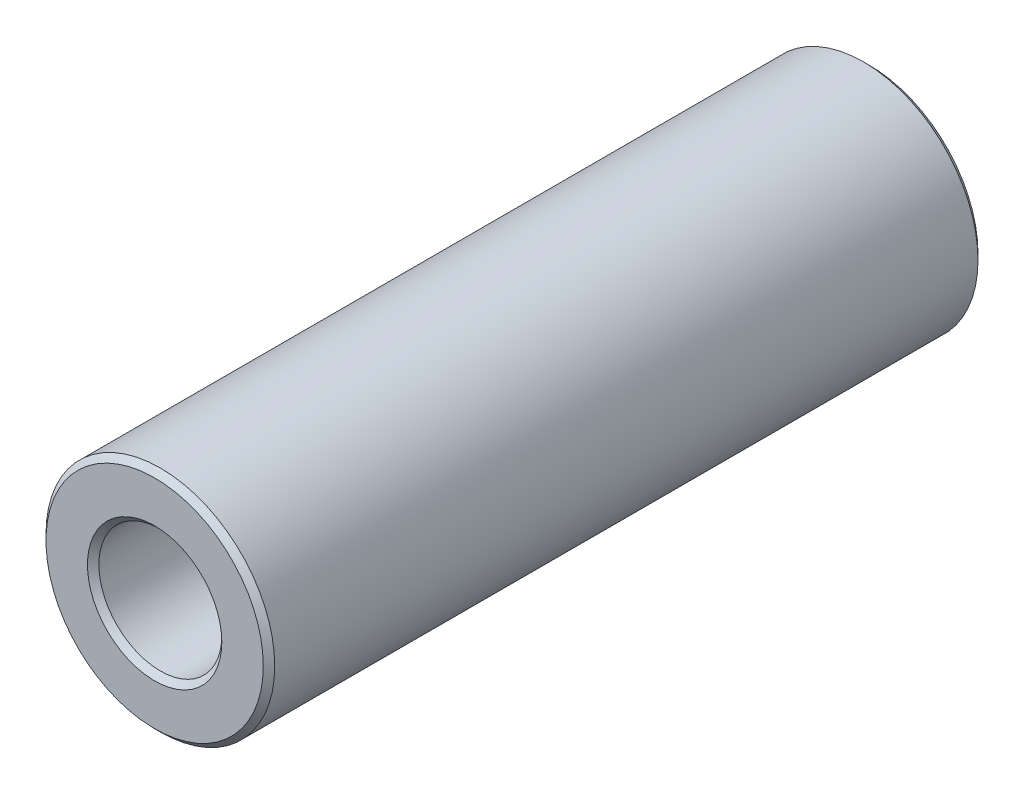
from build123d import *

# Parameters (mm, degrees)
SKETCH1_R           = 4
SKETCH1_R_2         = 2.15
BOSS_EXTRUDE2_DEPTH = 12.5
CHAMFER3_SIZE       = 0.2


with BuildPart() as part:
    # Sketch1 → Boss-Extrude2 (new, symmetric)
    with BuildSketch(Plane.XY):
        Circle(SKETCH1_R)
        Circle(SKETCH1_R_2, mode=Mode.SUBTRACT)
    extrude(amount=BOSS_EXTRUDE2_DEPTH, both=True)

    # Chamfer3
    chamfer3_edges = [part.edges().sort_by_distance(p)[0] for p in [
        (-4, 0, -12.5),
        (-4, 0, 12.5),
        (-2.15, 0, -12.5),
        (-2.15, 0, 12.5),
    ]]
    chamfer(chamfer3_edges, length=CHAMFER3_SIZE)


solid = part.part
